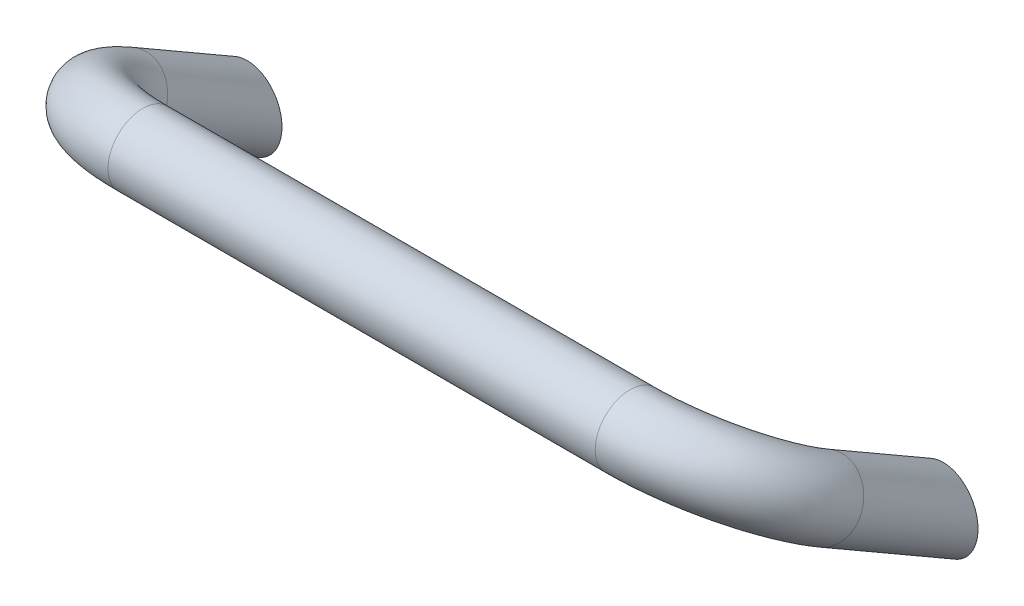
ISO-10303-21;
HEADER;
FILE_DESCRIPTION(('STEP AP214'),'2;1');
FILE_NAME('part.step','',(''),(''),'','','');
FILE_SCHEMA(('AUTOMOTIVE_DESIGN { 1 0 10303 214 1 1 1 1 }'));
ENDSEC;
DATA;
#1=APPLICATION_CONTEXT('core data for automotive mechanical design processes');
#2=APPLICATION_PROTOCOL_DEFINITION('international standard','automotive_design',2000,#1);
#3=PRODUCT_CONTEXT('',#1,'mechanical');
#4=PRODUCT('Part','Part','',(#3));
#5=PRODUCT_RELATED_PRODUCT_CATEGORY('part','',(#4));
#6=PRODUCT_DEFINITION_FORMATION('','',#4);
#7=PRODUCT_DEFINITION_CONTEXT('part definition',#1,'design');
#8=PRODUCT_DEFINITION('design','',#6,#7);
#9=PRODUCT_DEFINITION_SHAPE('','',#8);
#10=(LENGTH_UNIT() NAMED_UNIT(*) SI_UNIT(.MILLI.,.METRE.));
#11=(NAMED_UNIT(*) PLANE_ANGLE_UNIT() SI_UNIT($,.RADIAN.));
#12=(NAMED_UNIT(*) SI_UNIT($,.STERADIAN.) SOLID_ANGLE_UNIT());
#13=UNCERTAINTY_MEASURE_WITH_UNIT(LENGTH_MEASURE(1.E-05),#10,'distance_accuracy_value','');
#14=(GEOMETRIC_REPRESENTATION_CONTEXT(3) GLOBAL_UNCERTAINTY_ASSIGNED_CONTEXT((#13)) GLOBAL_UNIT_ASSIGNED_CONTEXT((#10,
#11,#12)) REPRESENTATION_CONTEXT('',''));
#15=CARTESIAN_POINT('',(0.,0.,0.));
#16=DIRECTION('',(0.,0.,1.));
#17=DIRECTION('',(1.,0.,0.));
#18=AXIS2_PLACEMENT_3D('',#15,#16,#17);
#19=CARTESIAN_POINT('',(200.,0.,-5.68396051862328E-11));
#20=DIRECTION('',(0.,0.,-1.));
#21=DIRECTION('',(0.,1.,0.));
#22=AXIS2_PLACEMENT_3D('',#19,#20,#21);
#23=CONICAL_SURFACE('',#22,4.25000000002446,0.785398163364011);
#24=CARTESIAN_POINT('',(200.,0.,0.249999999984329));
#25=DIRECTION('',(0.,0.,-1.));
#26=DIRECTION('',(0.,1.,0.));
#27=AXIS2_PLACEMENT_3D('',#24,#25,#26);
#28=CIRCLE('',#27,4.);
#29=CARTESIAN_POINT('',(200.,4.,0.249999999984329));
#30=VERTEX_POINT('',#29);
#31=EDGE_CURVE('E15',#30,#30,#28,.F.);
#32=ORIENTED_EDGE('',*,*,#31,.T.);
#33=EDGE_LOOP('',(#32));
#34=FACE_BOUND('',#33,.T.);
#35=CARTESIAN_POINT('',(200.,0.,-5.68396051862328E-11));
#36=DIRECTION('',(0.,0.,-1.));
#37=DIRECTION('',(0.,1.,0.));
#38=AXIS2_PLACEMENT_3D('',#35,#36,#37);
#39=CIRCLE('',#38,4.25000000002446);
#40=CARTESIAN_POINT('',(200.,4.25000000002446,-5.68396051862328E-11));
#41=VERTEX_POINT('',#40);
#42=EDGE_CURVE('E105',#41,#41,#39,.T.);
#43=ORIENTED_EDGE('',*,*,#42,.T.);
#44=EDGE_LOOP('',(#43));
#45=FACE_BOUND('',#44,.T.);
#46=ADVANCED_FACE('F12',(#34,#45),#23,.F.);
#47=CARTESIAN_POINT('',(0.,0.,-5.68396051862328E-11));
#48=DIRECTION('',(0.,0.,-1.));
#49=DIRECTION('',(0.,1.,0.));
#50=AXIS2_PLACEMENT_3D('',#47,#48,#49);
#51=CONICAL_SURFACE('',#50,4.25000000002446,0.785398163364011);
#52=CARTESIAN_POINT('',(0.,0.,0.249999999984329));
#53=DIRECTION('',(0.,0.,-1.));
#54=DIRECTION('',(0.,1.,0.));
#55=AXIS2_PLACEMENT_3D('',#52,#53,#54);
#56=CIRCLE('',#55,4.);
#57=CARTESIAN_POINT('',(0.,4.,0.249999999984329));
#58=VERTEX_POINT('',#57);
#59=EDGE_CURVE('E100',#58,#58,#56,.F.);
#60=ORIENTED_EDGE('',*,*,#59,.T.);
#61=EDGE_LOOP('',(#60));
#62=FACE_BOUND('',#61,.T.);
#63=CARTESIAN_POINT('',(0.,0.,-5.68396051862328E-11));
#64=DIRECTION('',(0.,0.,-1.));
#65=DIRECTION('',(0.,1.,0.));
#66=AXIS2_PLACEMENT_3D('',#63,#64,#65);
#67=CIRCLE('',#66,4.25000000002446);
#68=CARTESIAN_POINT('',(0.,4.25000000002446,-5.68396051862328E-11));
#69=VERTEX_POINT('',#68);
#70=EDGE_CURVE('E109',#69,#69,#67,.T.);
#71=ORIENTED_EDGE('',*,*,#70,.T.);
#72=EDGE_LOOP('',(#71));
#73=FACE_BOUND('',#72,.T.);
#74=ADVANCED_FACE('F60',(#62,#73),#51,.F.);
#75=CARTESIAN_POINT('',(-10.,31.1410161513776,0.));
#76=DIRECTION('',(0.,0.,1.));
#77=DIRECTION('',(0.,-1.,0.));
#78=AXIS2_PLACEMENT_3D('',#75,#76,#77);
#79=PLANE('',#78);
#80=ORIENTED_EDGE('',*,*,#42,.F.);
#81=EDGE_LOOP('',(#80));
#82=FACE_BOUND('',#81,.T.);
#83=CARTESIAN_POINT('',(200.,-3.5,0.));
#84=DIRECTION('',(0.,0.,1.));
#85=DIRECTION('',(0.,1.,0.));
#86=AXIS2_PLACEMENT_3D('',#83,#84,#85);
#87=ELLIPSE('',#86,11.5470053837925,10.);
#88=CARTESIAN_POINT('',(200.,8.04700538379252,0.));
#89=VERTEX_POINT('',#88);
#90=EDGE_CURVE('E112',#89,#89,#87,.T.);
#91=ORIENTED_EDGE('',*,*,#90,.F.);
#92=EDGE_LOOP('',(#91));
#93=FACE_BOUND('',#92,.T.);
#94=ADVANCED_FACE('F57',(#82,#93),#79,.F.);
#95=CARTESIAN_POINT('',(-10.,31.1410161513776,0.));
#96=DIRECTION('',(0.,0.,1.));
#97=DIRECTION('',(0.,-1.,0.));
#98=AXIS2_PLACEMENT_3D('',#95,#96,#97);
#99=PLANE('',#98);
#100=ORIENTED_EDGE('',*,*,#70,.F.);
#101=EDGE_LOOP('',(#100));
#102=FACE_BOUND('',#101,.T.);
#103=CARTESIAN_POINT('',(0.,-3.5,0.));
#104=DIRECTION('',(0.,0.,1.));
#105=DIRECTION('',(0.,1.,0.));
#106=AXIS2_PLACEMENT_3D('',#103,#104,#105);
#107=ELLIPSE('',#106,11.5470053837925,10.);
#108=CARTESIAN_POINT('',(0.,8.04700538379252,0.));
#109=VERTEX_POINT('',#108);
#110=EDGE_CURVE('E115',#109,#109,#107,.T.);
#111=ORIENTED_EDGE('',*,*,#110,.F.);
#112=EDGE_LOOP('',(#111));
#113=FACE_BOUND('',#112,.T.);
#114=ADVANCED_FACE('F53',(#102,#113),#99,.F.);
#115=CARTESIAN_POINT('',(200.,16.1410161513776,34.0192378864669));
#116=DIRECTION('',(0.,0.5,0.866025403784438));
#117=DIRECTION('',(0.,-0.866025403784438,0.5));
#118=AXIS2_PLACEMENT_3D('',#115,#116,#117);
#119=CYLINDRICAL_SURFACE('',#118,10.);
#120=ORIENTED_EDGE('',*,*,#90,.T.);
#121=EDGE_LOOP('',(#120));
#122=FACE_BOUND('',#121,.T.);
#123=CARTESIAN_POINT('',(200.,16.1410161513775,34.0192378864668));
#124=DIRECTION('',(0.,-0.5,-0.866025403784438));
#125=DIRECTION('',(1.,0.,0.));
#126=AXIS2_PLACEMENT_3D('',#123,#124,#125);
#127=CIRCLE('',#126,10.);
#128=CARTESIAN_POINT('',(210.,16.1410161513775,34.0192378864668));
#129=VERTEX_POINT('',#128);
#130=EDGE_CURVE('E118',#129,#129,#127,.F.);
#131=ORIENTED_EDGE('',*,*,#130,.F.);
#132=EDGE_LOOP('',(#131));
#133=FACE_BOUND('',#132,.T.);
#134=ADVANCED_FACE('F49',(#122,#133),#119,.T.);
#135=CARTESIAN_POINT('',(0.,16.1410161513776,34.0192378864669));
#136=DIRECTION('',(0.,0.5,0.866025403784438));
#137=DIRECTION('',(0.,-0.866025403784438,0.5));
#138=AXIS2_PLACEMENT_3D('',#135,#136,#137);
#139=CYLINDRICAL_SURFACE('',#138,10.);
#140=CARTESIAN_POINT('',(0.,16.1410161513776,34.0192378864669));
#141=DIRECTION('',(0.,-0.5,-0.866025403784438));
#142=DIRECTION('',(-1.,0.,0.));
#143=AXIS2_PLACEMENT_3D('',#140,#141,#142);
#144=CIRCLE('',#143,10.);
#145=CARTESIAN_POINT('',(-10.,16.1410161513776,34.0192378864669));
#146=VERTEX_POINT('',#145);
#147=EDGE_CURVE('E24',#146,#146,#144,.F.);
#148=ORIENTED_EDGE('',*,*,#147,.F.);
#149=EDGE_LOOP('',(#148));
#150=FACE_BOUND('',#149,.T.);
#151=ORIENTED_EDGE('',*,*,#110,.T.);
#152=EDGE_LOOP('',(#151));
#153=FACE_BOUND('',#152,.T.);
#154=ADVANCED_FACE('F45',(#150,#153),#139,.T.);
#155=CARTESIAN_POINT('',(170.,16.1410161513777,34.0192378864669));
#156=DIRECTION('',(0.,0.866025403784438,-0.5));
#157=DIRECTION('',(0.,0.5,0.866025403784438));
#158=AXIS2_PLACEMENT_3D('',#155,#156,#157);
#159=TOROIDAL_SURFACE('',#158,30.,10.);
#160=ORIENTED_EDGE('',*,*,#130,.T.);
#161=EDGE_LOOP('',(#160));
#162=FACE_BOUND('',#161,.T.);
#163=CARTESIAN_POINT('',(170.,31.1410161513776,60.));
#164=DIRECTION('',(1.,0.,0.));
#165=DIRECTION('',(0.,1.,0.));
#166=AXIS2_PLACEMENT_3D('',#163,#164,#165);
#167=CIRCLE('',#166,10.);
#168=CARTESIAN_POINT('',(170.,41.1410161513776,60.));
#169=VERTEX_POINT('',#168);
#170=EDGE_CURVE('E19',#169,#169,#167,.F.);
#171=ORIENTED_EDGE('',*,*,#170,.F.);
#172=EDGE_LOOP('',(#171));
#173=FACE_BOUND('',#172,.T.);
#174=ADVANCED_FACE('F40',(#162,#173),#159,.T.);
#175=CARTESIAN_POINT('',(30.,16.1410161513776,34.0192378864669));
#176=DIRECTION('',(0.,-0.866025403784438,0.5));
#177=DIRECTION('',(0.,-0.5,-0.866025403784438));
#178=AXIS2_PLACEMENT_3D('',#175,#176,#177);
#179=TOROIDAL_SURFACE('',#178,30.,10.);
#180=ORIENTED_EDGE('',*,*,#147,.T.);
#181=EDGE_LOOP('',(#180));
#182=FACE_BOUND('',#181,.T.);
#183=CARTESIAN_POINT('',(30.,31.1410161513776,60.));
#184=DIRECTION('',(1.,0.,0.));
#185=DIRECTION('',(0.,1.,0.));
#186=AXIS2_PLACEMENT_3D('',#183,#184,#185);
#187=CIRCLE('',#186,10.);
#188=CARTESIAN_POINT('',(30.,41.1410161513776,60.));
#189=VERTEX_POINT('',#188);
#190=EDGE_CURVE('E8',#189,#189,#187,.T.);
#191=ORIENTED_EDGE('',*,*,#190,.F.);
#192=EDGE_LOOP('',(#191));
#193=FACE_BOUND('',#192,.T.);
#194=ADVANCED_FACE('F35',(#182,#193),#179,.T.);
#195=CARTESIAN_POINT('',(170.,31.1410161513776,60.));
#196=DIRECTION('',(1.,0.,0.));
#197=DIRECTION('',(0.,1.,0.));
#198=AXIS2_PLACEMENT_3D('',#195,#196,#197);
#199=CYLINDRICAL_SURFACE('',#198,10.);
#200=ORIENTED_EDGE('',*,*,#170,.T.);
#201=EDGE_LOOP('',(#200));
#202=FACE_BOUND('',#201,.T.);
#203=ORIENTED_EDGE('',*,*,#190,.T.);
#204=EDGE_LOOP('',(#203));
#205=FACE_BOUND('',#204,.T.);
#206=ADVANCED_FACE('F39',(#202,#205),#199,.T.);
#207=CARTESIAN_POINT('',(0.,0.,12.));
#208=DIRECTION('',(0.,0.,-1.));
#209=DIRECTION('',(0.,1.,0.));
#210=AXIS2_PLACEMENT_3D('',#207,#208,#209);
#211=PLANE('',#210);
#212=CARTESIAN_POINT('',(0.,0.,12.));
#213=DIRECTION('',(0.,0.,-1.));
#214=DIRECTION('',(0.,1.,0.));
#215=AXIS2_PLACEMENT_3D('',#212,#213,#214);
#216=CIRCLE('',#215,4.);
#217=CARTESIAN_POINT('',(0.,4.,12.));
#218=VERTEX_POINT('',#217);
#219=EDGE_CURVE('E27',#218,#218,#216,.T.);
#220=ORIENTED_EDGE('',*,*,#219,.T.);
#221=EDGE_LOOP('',(#220));
#222=FACE_BOUND('',#221,.T.);
#223=ADVANCED_FACE('F69',(#222),#211,.T.);
#224=CARTESIAN_POINT('',(0.,0.,12.));
#225=DIRECTION('',(0.,0.,-1.));
#226=DIRECTION('',(0.,1.,0.));
#227=AXIS2_PLACEMENT_3D('',#224,#225,#226);
#228=CYLINDRICAL_SURFACE('',#227,4.);
#229=ORIENTED_EDGE('',*,*,#219,.F.);
#230=EDGE_LOOP('',(#229));
#231=FACE_BOUND('',#230,.T.);
#232=ORIENTED_EDGE('',*,*,#59,.F.);
#233=EDGE_LOOP('',(#232));
#234=FACE_BOUND('',#233,.T.);
#235=ADVANCED_FACE('F77',(#231,#234),#228,.F.);
#236=CARTESIAN_POINT('',(200.,0.,12.));
#237=DIRECTION('',(0.,0.,-1.));
#238=DIRECTION('',(0.,1.,0.));
#239=AXIS2_PLACEMENT_3D('',#236,#237,#238);
#240=PLANE('',#239);
#241=CARTESIAN_POINT('',(200.,0.,12.));
#242=DIRECTION('',(0.,0.,-1.));
#243=DIRECTION('',(0.,1.,0.));
#244=AXIS2_PLACEMENT_3D('',#241,#242,#243);
#245=CIRCLE('',#244,4.);
#246=CARTESIAN_POINT('',(200.,4.,12.));
#247=VERTEX_POINT('',#246);
#248=EDGE_CURVE('E99',#247,#247,#245,.T.);
#249=ORIENTED_EDGE('',*,*,#248,.T.);
#250=EDGE_LOOP('',(#249));
#251=FACE_BOUND('',#250,.T.);
#252=ADVANCED_FACE('F85',(#251),#240,.T.);
#253=CARTESIAN_POINT('',(200.,0.,12.));
#254=DIRECTION('',(0.,0.,-1.));
#255=DIRECTION('',(0.,1.,0.));
#256=AXIS2_PLACEMENT_3D('',#253,#254,#255);
#257=CYLINDRICAL_SURFACE('',#256,4.);
#258=ORIENTED_EDGE('',*,*,#248,.F.);
#259=EDGE_LOOP('',(#258));
#260=FACE_BOUND('',#259,.T.);
#261=ORIENTED_EDGE('',*,*,#31,.F.);
#262=EDGE_LOOP('',(#261));
#263=FACE_BOUND('',#262,.T.);
#264=ADVANCED_FACE('F89',(#260,#263),#257,.F.);
#265=CLOSED_SHELL('',(#46,#74,#94,#114,#134,#154,#174,#194,#206,#223,#235,#252,#264));
#266=MANIFOLD_SOLID_BREP('B1',#265);
#267=ADVANCED_BREP_SHAPE_REPRESENTATION('',(#18,#266),#14);
#268=SHAPE_DEFINITION_REPRESENTATION(#9,#267);
ENDSEC;
END-ISO-10303-21;
